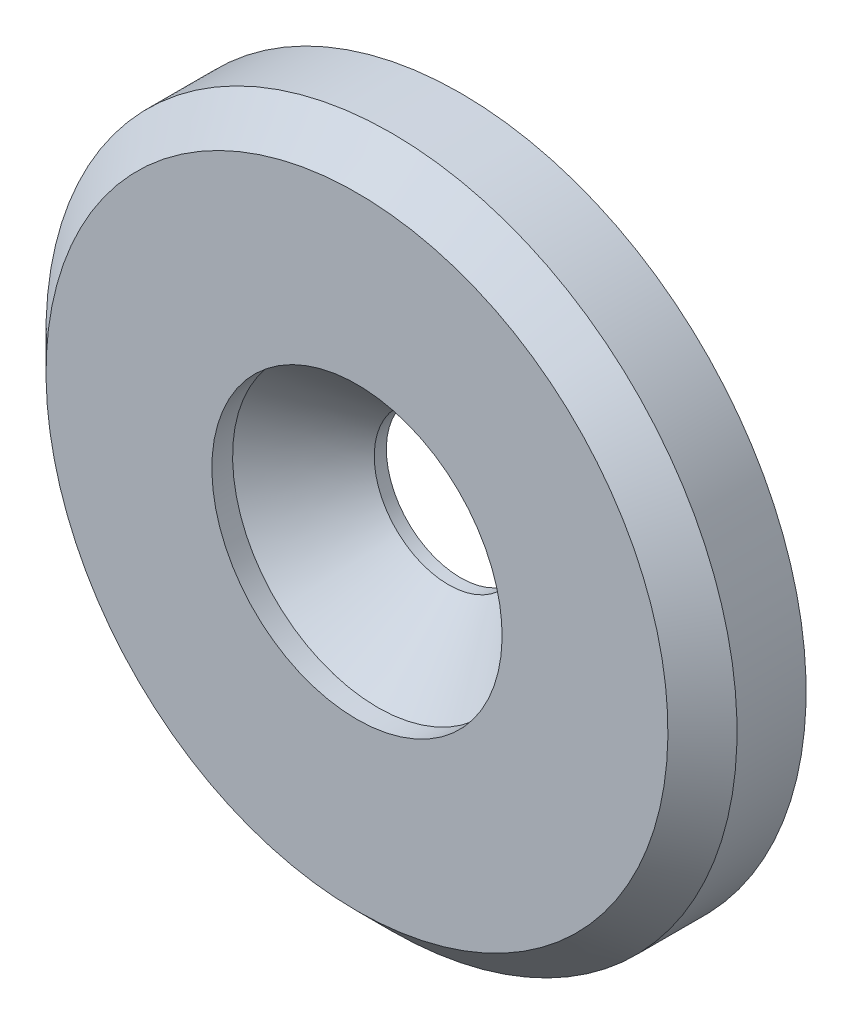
ISO-10303-21;
HEADER;
FILE_DESCRIPTION(('STEP AP214'),'2;1');
FILE_NAME('part.step','',(''),(''),'','','');
FILE_SCHEMA(('AUTOMOTIVE_DESIGN { 1 0 10303 214 1 1 1 1 }'));
ENDSEC;
DATA;
#1=APPLICATION_CONTEXT('core data for automotive mechanical design processes');
#2=APPLICATION_PROTOCOL_DEFINITION('international standard','automotive_design',2000,#1);
#3=PRODUCT_CONTEXT('',#1,'mechanical');
#4=PRODUCT('Part','Part','',(#3));
#5=PRODUCT_RELATED_PRODUCT_CATEGORY('part','',(#4));
#6=PRODUCT_DEFINITION_FORMATION('','',#4);
#7=PRODUCT_DEFINITION_CONTEXT('part definition',#1,'design');
#8=PRODUCT_DEFINITION('design','',#6,#7);
#9=PRODUCT_DEFINITION_SHAPE('','',#8);
#10=(LENGTH_UNIT() NAMED_UNIT(*) SI_UNIT(.MILLI.,.METRE.));
#11=(NAMED_UNIT(*) PLANE_ANGLE_UNIT() SI_UNIT($,.RADIAN.));
#12=(NAMED_UNIT(*) SI_UNIT($,.STERADIAN.) SOLID_ANGLE_UNIT());
#13=UNCERTAINTY_MEASURE_WITH_UNIT(LENGTH_MEASURE(1.E-05),#10,'distance_accuracy_value','');
#14=(GEOMETRIC_REPRESENTATION_CONTEXT(3) GLOBAL_UNCERTAINTY_ASSIGNED_CONTEXT((#13)) GLOBAL_UNIT_ASSIGNED_CONTEXT((#10,
#11,#12)) REPRESENTATION_CONTEXT('',''));
#15=CARTESIAN_POINT('',(0.,0.,0.));
#16=DIRECTION('',(0.,0.,1.));
#17=DIRECTION('',(1.,0.,0.));
#18=AXIS2_PLACEMENT_3D('',#15,#16,#17);
#19=CARTESIAN_POINT('',(0.,0.,0.35));
#20=DIRECTION('',(0.,0.,1.));
#21=DIRECTION('',(0.,-1.,0.));
#22=AXIS2_PLACEMENT_3D('',#19,#20,#21);
#23=CONICAL_SURFACE('',#22,2.15,0.785398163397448);
#24=CARTESIAN_POINT('',(0.,0.,2.4));
#25=DIRECTION('',(0.,0.,1.));
#26=DIRECTION('',(0.,-1.,0.));
#27=AXIS2_PLACEMENT_3D('',#24,#25,#26);
#28=CIRCLE('',#27,4.2);
#29=CARTESIAN_POINT('',(0.,-4.2,2.4));
#30=VERTEX_POINT('',#29);
#31=EDGE_CURVE('E37',#30,#30,#28,.T.);
#32=ORIENTED_EDGE('',*,*,#31,.T.);
#33=EDGE_LOOP('',(#32));
#34=FACE_BOUND('',#33,.T.);
#35=CARTESIAN_POINT('',(0.,0.,0.35));
#36=DIRECTION('',(0.,0.,1.));
#37=DIRECTION('',(0.,-1.,0.));
#38=AXIS2_PLACEMENT_3D('',#35,#36,#37);
#39=CIRCLE('',#38,2.15);
#40=CARTESIAN_POINT('',(0.,-2.15,0.35));
#41=VERTEX_POINT('',#40);
#42=EDGE_CURVE('E8',#41,#41,#39,.T.);
#43=ORIENTED_EDGE('',*,*,#42,.F.);
#44=EDGE_LOOP('',(#43));
#45=FACE_BOUND('',#44,.T.);
#46=ADVANCED_FACE('F12',(#34,#45),#23,.F.);
#47=CARTESIAN_POINT('',(0.,0.,3.29732137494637));
#48=DIRECTION('',(0.,0.,1.));
#49=DIRECTION('',(0.,-1.,0.));
#50=AXIS2_PLACEMENT_3D('',#47,#48,#49);
#51=CYLINDRICAL_SURFACE('',#50,2.15);
#52=ORIENTED_EDGE('',*,*,#42,.T.);
#53=EDGE_LOOP('',(#52));
#54=FACE_BOUND('',#53,.T.);
#55=CARTESIAN_POINT('',(0.,0.,0.));
#56=DIRECTION('',(0.,0.,1.));
#57=DIRECTION('',(0.,-1.,0.));
#58=AXIS2_PLACEMENT_3D('',#55,#56,#57);
#59=CIRCLE('',#58,2.15);
#60=CARTESIAN_POINT('',(0.,-2.15,0.));
#61=VERTEX_POINT('',#60);
#62=EDGE_CURVE('E18',#61,#61,#59,.T.);
#63=ORIENTED_EDGE('',*,*,#62,.F.);
#64=EDGE_LOOP('',(#63));
#65=FACE_BOUND('',#64,.T.);
#66=ADVANCED_FACE('F57',(#54,#65),#51,.F.);
#67=CARTESIAN_POINT('',(-2.15,0.,0.));
#68=DIRECTION('',(0.,0.,-1.));
#69=DIRECTION('',(0.,1.,0.));
#70=AXIS2_PLACEMENT_3D('',#67,#68,#69);
#71=PLANE('',#70);
#72=ORIENTED_EDGE('',*,*,#62,.T.);
#73=EDGE_LOOP('',(#72));
#74=FACE_BOUND('',#73,.T.);
#75=CARTESIAN_POINT('',(0.,0.,0.));
#76=DIRECTION('',(0.,0.,1.));
#77=DIRECTION('',(0.,-1.,0.));
#78=AXIS2_PLACEMENT_3D('',#75,#76,#77);
#79=CIRCLE('',#78,10.);
#80=CARTESIAN_POINT('',(0.,-10.,0.));
#81=VERTEX_POINT('',#80);
#82=EDGE_CURVE('E22',#81,#81,#79,.T.);
#83=ORIENTED_EDGE('',*,*,#82,.F.);
#84=EDGE_LOOP('',(#83));
#85=FACE_BOUND('',#84,.T.);
#86=ADVANCED_FACE('F62',(#74,#85),#71,.T.);
#87=CARTESIAN_POINT('',(0.,0.,3.29732137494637));
#88=DIRECTION('',(0.,0.,1.));
#89=DIRECTION('',(0.,-1.,0.));
#90=AXIS2_PLACEMENT_3D('',#87,#88,#89);
#91=CYLINDRICAL_SURFACE('',#90,10.);
#92=ORIENTED_EDGE('',*,*,#82,.T.);
#93=EDGE_LOOP('',(#92));
#94=FACE_BOUND('',#93,.T.);
#95=CARTESIAN_POINT('',(0.,0.,2.));
#96=DIRECTION('',(0.,0.,1.));
#97=DIRECTION('',(0.,-1.,0.));
#98=AXIS2_PLACEMENT_3D('',#95,#96,#97);
#99=CIRCLE('',#98,10.);
#100=CARTESIAN_POINT('',(0.,-10.,2.));
#101=VERTEX_POINT('',#100);
#102=EDGE_CURVE('E26',#101,#101,#99,.T.);
#103=ORIENTED_EDGE('',*,*,#102,.F.);
#104=EDGE_LOOP('',(#103));
#105=FACE_BOUND('',#104,.T.);
#106=ADVANCED_FACE('F67',(#94,#105),#91,.T.);
#107=CARTESIAN_POINT('',(0.,0.,3.));
#108=DIRECTION('',(0.,0.,-1.));
#109=DIRECTION('',(0.,1.,0.));
#110=AXIS2_PLACEMENT_3D('',#107,#108,#109);
#111=CONICAL_SURFACE('',#110,9.,0.785398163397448);
#112=ORIENTED_EDGE('',*,*,#102,.T.);
#113=EDGE_LOOP('',(#112));
#114=FACE_BOUND('',#113,.T.);
#115=CARTESIAN_POINT('',(0.,0.,3.));
#116=DIRECTION('',(0.,0.,1.));
#117=DIRECTION('',(0.,-1.,0.));
#118=AXIS2_PLACEMENT_3D('',#115,#116,#117);
#119=CIRCLE('',#118,9.);
#120=CARTESIAN_POINT('',(0.,-9.,3.));
#121=VERTEX_POINT('',#120);
#122=EDGE_CURVE('E31',#121,#121,#119,.T.);
#123=ORIENTED_EDGE('',*,*,#122,.F.);
#124=EDGE_LOOP('',(#123));
#125=FACE_BOUND('',#124,.T.);
#126=ADVANCED_FACE('F53',(#114,#125),#111,.T.);
#127=CARTESIAN_POINT('',(-4.2,0.,3.));
#128=DIRECTION('',(0.,0.,1.));
#129=DIRECTION('',(0.,-1.,0.));
#130=AXIS2_PLACEMENT_3D('',#127,#128,#129);
#131=PLANE('',#130);
#132=ORIENTED_EDGE('',*,*,#122,.T.);
#133=EDGE_LOOP('',(#132));
#134=FACE_BOUND('',#133,.T.);
#135=CARTESIAN_POINT('',(0.,0.,3.));
#136=DIRECTION('',(0.,0.,1.));
#137=DIRECTION('',(0.,-1.,0.));
#138=AXIS2_PLACEMENT_3D('',#135,#136,#137);
#139=CIRCLE('',#138,4.2);
#140=CARTESIAN_POINT('',(0.,-4.2,3.));
#141=VERTEX_POINT('',#140);
#142=EDGE_CURVE('E34',#141,#141,#139,.T.);
#143=ORIENTED_EDGE('',*,*,#142,.F.);
#144=EDGE_LOOP('',(#143));
#145=FACE_BOUND('',#144,.T.);
#146=ADVANCED_FACE('F45',(#134,#145),#131,.T.);
#147=CARTESIAN_POINT('',(0.,0.,3.29732137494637));
#148=DIRECTION('',(0.,0.,1.));
#149=DIRECTION('',(0.,-1.,0.));
#150=AXIS2_PLACEMENT_3D('',#147,#148,#149);
#151=CYLINDRICAL_SURFACE('',#150,4.2);
#152=ORIENTED_EDGE('',*,*,#142,.T.);
#153=EDGE_LOOP('',(#152));
#154=FACE_BOUND('',#153,.T.);
#155=ORIENTED_EDGE('',*,*,#31,.F.);
#156=EDGE_LOOP('',(#155));
#157=FACE_BOUND('',#156,.T.);
#158=ADVANCED_FACE('F43',(#154,#157),#151,.F.);
#159=CLOSED_SHELL('',(#46,#66,#86,#106,#126,#146,#158));
#160=MANIFOLD_SOLID_BREP('B1',#159);
#161=ADVANCED_BREP_SHAPE_REPRESENTATION('',(#18,#160),#14);
#162=SHAPE_DEFINITION_REPRESENTATION(#9,#161);
ENDSEC;
END-ISO-10303-21;
